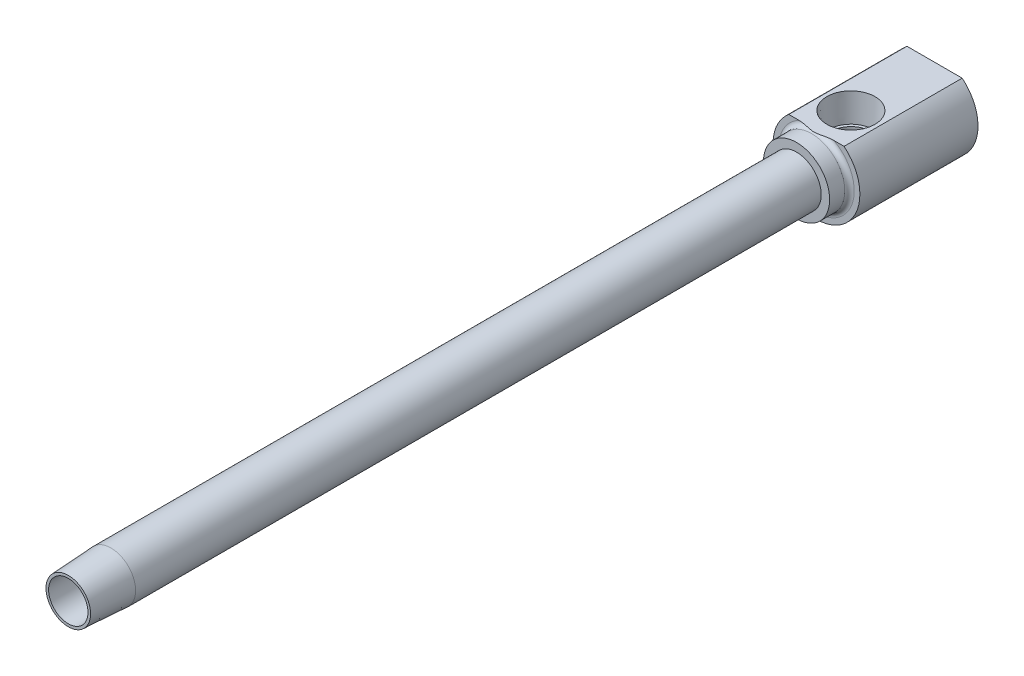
ISO-10303-21;
HEADER;
FILE_DESCRIPTION(('STEP AP214'),'2;1');
FILE_NAME('part.step','',(''),(''),'','','');
FILE_SCHEMA(('AUTOMOTIVE_DESIGN { 1 0 10303 214 1 1 1 1 }'));
ENDSEC;
DATA;
#1=APPLICATION_CONTEXT('core data for automotive mechanical design processes');
#2=APPLICATION_PROTOCOL_DEFINITION('international standard','automotive_design',2000,#1);
#3=PRODUCT_CONTEXT('',#1,'mechanical');
#4=PRODUCT('Part','Part','',(#3));
#5=PRODUCT_RELATED_PRODUCT_CATEGORY('part','',(#4));
#6=PRODUCT_DEFINITION_FORMATION('','',#4);
#7=PRODUCT_DEFINITION_CONTEXT('part definition',#1,'design');
#8=PRODUCT_DEFINITION('design','',#6,#7);
#9=PRODUCT_DEFINITION_SHAPE('','',#8);
#10=(LENGTH_UNIT() NAMED_UNIT(*) SI_UNIT(.MILLI.,.METRE.));
#11=(NAMED_UNIT(*) PLANE_ANGLE_UNIT() SI_UNIT($,.RADIAN.));
#12=(NAMED_UNIT(*) SI_UNIT($,.STERADIAN.) SOLID_ANGLE_UNIT());
#13=UNCERTAINTY_MEASURE_WITH_UNIT(LENGTH_MEASURE(1.E-05),#10,'distance_accuracy_value','');
#14=(GEOMETRIC_REPRESENTATION_CONTEXT(3) GLOBAL_UNCERTAINTY_ASSIGNED_CONTEXT((#13)) GLOBAL_UNIT_ASSIGNED_CONTEXT((#10,
#11,#12)) REPRESENTATION_CONTEXT('',''));
#15=CARTESIAN_POINT('',(0.,0.,0.));
#16=DIRECTION('',(0.,0.,1.));
#17=DIRECTION('',(1.,0.,0.));
#18=AXIS2_PLACEMENT_3D('',#15,#16,#17);
#19=CARTESIAN_POINT('',(0.,0.,-185.534766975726));
#20=DIRECTION('',(0.,0.,-1.));
#21=DIRECTION('',(-1.,0.,0.));
#22=AXIS2_PLACEMENT_3D('',#19,#20,#21);
#23=CYLINDRICAL_SURFACE('',#22,3.9751);
#24=CARTESIAN_POINT('',(0.,0.,-6.8834));
#25=DIRECTION('',(0.,0.,-1.));
#26=DIRECTION('',(-1.,0.,0.));
#27=AXIS2_PLACEMENT_3D('',#24,#25,#26);
#28=CIRCLE('',#27,3.9751);
#29=CARTESIAN_POINT('',(-3.9751,0.,-6.8834));
#30=VERTEX_POINT('',#29);
#31=EDGE_CURVE('E230',#30,#30,#28,.T.);
#32=ORIENTED_EDGE('',*,*,#31,.T.);
#33=EDGE_LOOP('',(#32));
#34=FACE_BOUND('',#33,.T.);
#35=CARTESIAN_POINT('',(0.,0.,-117.4496));
#36=DIRECTION('',(0.,0.,-1.));
#37=DIRECTION('',(-1.,0.,0.));
#38=AXIS2_PLACEMENT_3D('',#35,#36,#37);
#39=CIRCLE('',#38,3.9751);
#40=CARTESIAN_POINT('',(-3.9751,0.,-117.4496));
#41=VERTEX_POINT('',#40);
#42=EDGE_CURVE('E190',#41,#41,#39,.T.);
#43=ORIENTED_EDGE('',*,*,#42,.F.);
#44=EDGE_LOOP('',(#43));
#45=FACE_BOUND('',#44,.T.);
#46=ADVANCED_FACE('F15',(#34,#45),#23,.T.);
#47=CARTESIAN_POINT('',(-3.175,0.,-117.4496));
#48=DIRECTION('',(0.,0.,1.));
#49=DIRECTION('',(1.,0.,0.));
#50=AXIS2_PLACEMENT_3D('',#47,#48,#49);
#51=PLANE('',#50);
#52=CARTESIAN_POINT('',(0.,0.,-117.4496));
#53=DIRECTION('',(0.,0.,-1.));
#54=DIRECTION('',(-1.,0.,0.));
#55=AXIS2_PLACEMENT_3D('',#52,#53,#54);
#56=CIRCLE('',#55,3.175);
#57=CARTESIAN_POINT('',(-3.175,0.,-117.4496));
#58=VERTEX_POINT('',#57);
#59=EDGE_CURVE('E234',#58,#58,#56,.T.);
#60=ORIENTED_EDGE('',*,*,#59,.F.);
#61=EDGE_LOOP('',(#60));
#62=FACE_BOUND('',#61,.T.);
#63=CARTESIAN_POINT('',(0.,-0.206790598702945,-117.4496));
#64=DIRECTION('',(0.,0.,1.));
#65=DIRECTION('',(0.,1.,0.));
#66=AXIS2_PLACEMENT_3D('',#63,#64,#65);
#67=ELLIPSE('',#66,2.91070678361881,2.77750646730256);
#68=CARTESIAN_POINT('',(0.,2.70391618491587,-117.4496));
#69=VERTEX_POINT('',#68);
#70=EDGE_CURVE('E192',#69,#69,#67,.F.);
#71=ORIENTED_EDGE('',*,*,#70,.T.);
#72=EDGE_LOOP('',(#71));
#73=FACE_BOUND('',#72,.T.);
#74=ADVANCED_FACE('F211',(#62,#73),#51,.T.);
#75=CARTESIAN_POINT('',(-3.9751,0.,-117.4496));
#76=DIRECTION('',(0.,0.,1.));
#77=DIRECTION('',(1.,0.,0.));
#78=AXIS2_PLACEMENT_3D('',#75,#76,#77);
#79=PLANE('',#78);
#80=ORIENTED_EDGE('',*,*,#42,.T.);
#81=EDGE_LOOP('',(#80));
#82=FACE_BOUND('',#81,.T.);
#83=CARTESIAN_POINT('',(0.,0.,-117.4496));
#84=DIRECTION('',(0.,0.,-1.));
#85=DIRECTION('',(-1.,0.,0.));
#86=AXIS2_PLACEMENT_3D('',#83,#84,#85);
#87=CIRCLE('',#86,5.334);
#88=CARTESIAN_POINT('',(-5.334,0.,-117.4496));
#89=VERTEX_POINT('',#88);
#90=EDGE_CURVE('E252',#89,#89,#87,.T.);
#91=ORIENTED_EDGE('',*,*,#90,.F.);
#92=EDGE_LOOP('',(#91));
#93=FACE_BOUND('',#92,.T.);
#94=ADVANCED_FACE('F214',(#82,#93),#79,.T.);
#95=CARTESIAN_POINT('',(-3.175,0.,0.));
#96=DIRECTION('',(0.,0.,1.));
#97=DIRECTION('',(1.,0.,0.));
#98=AXIS2_PLACEMENT_3D('',#95,#96,#97);
#99=PLANE('',#98);
#100=CARTESIAN_POINT('',(0.,0.,0.));
#101=DIRECTION('',(0.,0.,-1.));
#102=DIRECTION('',(-1.,0.,0.));
#103=AXIS2_PLACEMENT_3D('',#100,#101,#102);
#104=CIRCLE('',#103,3.5941);
#105=CARTESIAN_POINT('',(-3.5941,0.,0.));
#106=VERTEX_POINT('',#105);
#107=EDGE_CURVE('E508',#106,#106,#104,.T.);
#108=ORIENTED_EDGE('',*,*,#107,.F.);
#109=EDGE_LOOP('',(#108));
#110=FACE_BOUND('',#109,.T.);
#111=CARTESIAN_POINT('',(0.,0.,0.));
#112=DIRECTION('',(0.,0.,-1.));
#113=DIRECTION('',(-1.,0.,0.));
#114=AXIS2_PLACEMENT_3D('',#111,#112,#113);
#115=CIRCLE('',#114,3.175);
#116=CARTESIAN_POINT('',(-3.175,0.,0.));
#117=VERTEX_POINT('',#116);
#118=EDGE_CURVE('E19',#117,#117,#115,.T.);
#119=ORIENTED_EDGE('',*,*,#118,.T.);
#120=EDGE_LOOP('',(#119));
#121=FACE_BOUND('',#120,.T.);
#122=ADVANCED_FACE('F17',(#110,#121),#99,.T.);
#123=CARTESIAN_POINT('',(0.,0.,-185.534766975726));
#124=DIRECTION('',(0.,0.,-1.));
#125=DIRECTION('',(-1.,0.,0.));
#126=AXIS2_PLACEMENT_3D('',#123,#124,#125);
#127=CYLINDRICAL_SURFACE('',#126,3.175);
#128=ORIENTED_EDGE('',*,*,#59,.T.);
#129=EDGE_LOOP('',(#128));
#130=FACE_BOUND('',#129,.T.);
#131=ORIENTED_EDGE('',*,*,#118,.F.);
#132=EDGE_LOOP('',(#131));
#133=FACE_BOUND('',#132,.T.);
#134=ADVANCED_FACE('F209',(#130,#133),#127,.F.);
#135=CARTESIAN_POINT('',(-7.0104,0.,-139.7));
#136=DIRECTION('',(0.,0.,-1.));
#137=DIRECTION('',(-1.,0.,0.));
#138=AXIS2_PLACEMENT_3D('',#135,#136,#137);
#139=PLANE('',#138);
#140=DIRECTION('',(1.,0.,0.));
#141=VECTOR('',#140,1.);
#142=CARTESIAN_POINT('',(-1.83308710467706,3.175,-139.7));
#143=LINE('',#142,#141);
#144=CARTESIAN_POINT('',(-1.83308710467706,3.175,-139.7));
#145=VERTEX_POINT('',#144);
#146=CARTESIAN_POINT('',(1.83308710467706,3.175,-139.7));
#147=VERTEX_POINT('',#146);
#148=EDGE_CURVE('E37',#145,#147,#143,.T.);
#149=ORIENTED_EDGE('',*,*,#148,.F.);
#150=DIRECTION('',(0.5,0.866025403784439,0.));
#151=VECTOR('',#150,1.);
#152=CARTESIAN_POINT('',(-3.66617420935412,0.,-139.7));
#153=LINE('',#152,#151);
#154=CARTESIAN_POINT('',(-3.66617420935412,0.,-139.7));
#155=VERTEX_POINT('',#154);
#156=EDGE_CURVE('E278',#155,#145,#153,.T.);
#157=ORIENTED_EDGE('',*,*,#156,.F.);
#158=DIRECTION('',(-0.5,0.866025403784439,0.));
#159=VECTOR('',#158,1.);
#160=CARTESIAN_POINT('',(-1.83308710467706,-3.175,-139.7));
#161=LINE('',#160,#159);
#162=CARTESIAN_POINT('',(-1.83308710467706,-3.175,-139.7));
#163=VERTEX_POINT('',#162);
#164=EDGE_CURVE('E282',#163,#155,#161,.T.);
#165=ORIENTED_EDGE('',*,*,#164,.F.);
#166=DIRECTION('',(-1.,0.,0.));
#167=VECTOR('',#166,1.);
#168=CARTESIAN_POINT('',(1.83308710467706,-3.175,-139.7));
#169=LINE('',#168,#167);
#170=CARTESIAN_POINT('',(1.83308710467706,-3.175,-139.7));
#171=VERTEX_POINT('',#170);
#172=EDGE_CURVE('E285',#171,#163,#169,.T.);
#173=ORIENTED_EDGE('',*,*,#172,.F.);
#174=DIRECTION('',(-0.5,-0.866025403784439,0.));
#175=VECTOR('',#174,1.);
#176=CARTESIAN_POINT('',(3.66617420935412,0.,-139.7));
#177=LINE('',#176,#175);
#178=CARTESIAN_POINT('',(3.66617420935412,0.,-139.7));
#179=VERTEX_POINT('',#178);
#180=EDGE_CURVE('E288',#179,#171,#177,.T.);
#181=ORIENTED_EDGE('',*,*,#180,.F.);
#182=DIRECTION('',(0.5,-0.866025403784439,0.));
#183=VECTOR('',#182,1.);
#184=CARTESIAN_POINT('',(1.83308710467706,3.175,-139.7));
#185=LINE('',#184,#183);
#186=EDGE_CURVE('E291',#147,#179,#185,.T.);
#187=ORIENTED_EDGE('',*,*,#186,.F.);
#188=EDGE_LOOP('',(#149,#157,#165,#173,#181,#187));
#189=FACE_BOUND('',#188,.T.);
#190=DIRECTION('',(-1.,0.,0.));
#191=VECTOR('',#190,1.);
#192=CARTESIAN_POINT('',(-4.4577,5.41060244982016,-139.7));
#193=LINE('',#192,#191);
#194=CARTESIAN_POINT('',(4.4577,5.41060244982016,-139.7));
#195=VERTEX_POINT('',#194);
#196=CARTESIAN_POINT('',(-4.4577,5.41060244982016,-139.7));
#197=VERTEX_POINT('',#196);
#198=EDGE_CURVE('E261',#195,#197,#193,.T.);
#199=ORIENTED_EDGE('',*,*,#198,.F.);
#200=CARTESIAN_POINT('',(0.,0.,-139.7));
#201=DIRECTION('',(0.,0.,-1.));
#202=DIRECTION('',(-1.,0.,0.));
#203=AXIS2_PLACEMENT_3D('',#200,#201,#202);
#204=CIRCLE('',#203,7.0104);
#205=EDGE_CURVE('E238',#195,#197,#204,.T.);
#206=ORIENTED_EDGE('',*,*,#205,.T.);
#207=EDGE_LOOP('',(#199,#206));
#208=FACE_BOUND('',#207,.T.);
#209=ADVANCED_FACE('F205',(#189,#208),#139,.T.);
#210=CARTESIAN_POINT('',(0.,0.,-185.534766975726));
#211=DIRECTION('',(0.,0.,-1.));
#212=DIRECTION('',(-1.,0.,0.));
#213=AXIS2_PLACEMENT_3D('',#210,#211,#212);
#214=CYLINDRICAL_SURFACE('',#213,7.0104);
#215=DIRECTION('',(0.,0.,-1.));
#216=VECTOR('',#215,1.);
#217=CARTESIAN_POINT('',(-4.4577,5.41060244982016,-110.3376));
#218=LINE('',#217,#216);
#219=CARTESIAN_POINT('',(-4.4577,5.41060244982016,-120.65));
#220=VERTEX_POINT('',#219);
#221=EDGE_CURVE('E258',#220,#197,#218,.T.);
#222=ORIENTED_EDGE('',*,*,#221,.T.);
#223=ORIENTED_EDGE('',*,*,#205,.F.);
#224=DIRECTION('',(0.,0.,-1.));
#225=VECTOR('',#224,1.);
#226=CARTESIAN_POINT('',(4.4577,5.41060244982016,-110.3376));
#227=LINE('',#226,#225);
#228=CARTESIAN_POINT('',(4.4577,5.41060244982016,-120.65));
#229=VERTEX_POINT('',#228);
#230=EDGE_CURVE('E259',#229,#195,#227,.T.);
#231=ORIENTED_EDGE('',*,*,#230,.F.);
#232=CARTESIAN_POINT('',(0.,0.,-120.65));
#233=DIRECTION('',(0.,0.,-1.));
#234=DIRECTION('',(-1.,0.,0.));
#235=AXIS2_PLACEMENT_3D('',#232,#233,#234);
#236=CIRCLE('',#235,7.0104);
#237=EDGE_CURVE('E241',#229,#220,#236,.T.);
#238=ORIENTED_EDGE('',*,*,#237,.T.);
#239=EDGE_LOOP('',(#222,#223,#231,#238));
#240=FACE_BOUND('',#239,.T.);
#241=ADVANCED_FACE('F201',(#240),#214,.T.);
#242=CARTESIAN_POINT('',(-6.096,0.,-120.65));
#243=DIRECTION('',(0.,0.,1.));
#244=DIRECTION('',(1.,0.,0.));
#245=AXIS2_PLACEMENT_3D('',#242,#243,#244);
#246=PLANE('',#245);
#247=DIRECTION('',(1.,0.,0.));
#248=VECTOR('',#247,1.);
#249=CARTESIAN_POINT('',(-6.096,5.41060244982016,-120.65));
#250=LINE('',#249,#248);
#251=CARTESIAN_POINT('',(-2.80830858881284,5.41060244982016,-120.65));
#252=VERTEX_POINT('',#251);
#253=EDGE_CURVE('E255',#220,#252,#250,.T.);
#254=ORIENTED_EDGE('',*,*,#253,.F.);
#255=ORIENTED_EDGE('',*,*,#237,.F.);
#256=CARTESIAN_POINT('',(2.80830858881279,5.41060244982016,-120.65));
#257=VERTEX_POINT('',#256);
#258=EDGE_CURVE('E256',#257,#229,#250,.T.);
#259=ORIENTED_EDGE('',*,*,#258,.F.);
#260=CARTESIAN_POINT('',(0.,0.,-120.65));
#261=DIRECTION('',(0.,0.,-1.));
#262=DIRECTION('',(-1.,0.,0.));
#263=AXIS2_PLACEMENT_3D('',#260,#261,#262);
#264=CIRCLE('',#263,6.096);
#265=EDGE_CURVE('E246',#257,#252,#264,.T.);
#266=ORIENTED_EDGE('',*,*,#265,.T.);
#267=EDGE_LOOP('',(#254,#255,#259,#266));
#268=FACE_BOUND('',#267,.T.);
#269=ADVANCED_FACE('F197',(#268),#246,.T.);
#270=CARTESIAN_POINT('',(0.,0.,-119.888));
#271=DIRECTION('',(0.,0.,-1.));
#272=DIRECTION('',(-1.,0.,0.));
#273=AXIS2_PLACEMENT_3D('',#270,#271,#272);
#274=TOROIDAL_SURFACE('',#273,6.096,0.762);
#275=CARTESIAN_POINT('',(0.,5.41060244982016,-120.220977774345));
#276=CARTESIAN_POINT('',(0.0521470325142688,5.41060244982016,-120.220966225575));
#277=CARTESIAN_POINT('',(0.104287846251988,5.41060244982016,-120.222542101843));
#278=CARTESIAN_POINT('',(0.208401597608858,5.41060244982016,-120.228631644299));
#279=CARTESIAN_POINT('',(0.260374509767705,5.41060244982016,-120.233145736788));
#280=CARTESIAN_POINT('',(0.416241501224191,5.41060244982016,-120.250448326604));
#281=CARTESIAN_POINT('',(0.519704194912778,5.41060244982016,-120.266991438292));
#282=CARTESIAN_POINT('',(0.726918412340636,5.41060244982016,-120.305619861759));
#283=CARTESIAN_POINT('',(0.830655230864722,5.41060244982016,-120.327776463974));
#284=CARTESIAN_POINT('',(1.03759009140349,5.41060244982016,-120.373840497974));
#285=CARTESIAN_POINT('',(1.14078865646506,5.41060244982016,-120.397745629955));
#286=CARTESIAN_POINT('',(1.34834228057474,5.41060244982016,-120.445205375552));
#287=CARTESIAN_POINT('',(1.4526986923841,5.41060244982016,-120.468754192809));
#288=CARTESIAN_POINT('',(1.6619797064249,5.41060244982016,-120.513460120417));
#289=CARTESIAN_POINT('',(1.76690452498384,5.41060244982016,-120.534616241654));
#290=CARTESIAN_POINT('',(1.97693672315,5.41060244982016,-120.572852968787));
#291=CARTESIAN_POINT('',(2.08204009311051,5.41060244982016,-120.589954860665));
#292=CARTESIAN_POINT('',(2.29298648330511,5.41060244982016,-120.618645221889));
#293=CARTESIAN_POINT('',(2.39882937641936,5.41060244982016,-120.630234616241));
#294=CARTESIAN_POINT('',(2.63825679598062,5.41060244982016,-120.648170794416));
#295=CARTESIAN_POINT('',(2.77203238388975,5.41060244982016,-120.652426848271));
#296=CARTESIAN_POINT('',(2.97236053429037,5.41060244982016,-120.64675427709));
#297=CARTESIAN_POINT('',(3.03908464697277,5.41060244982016,-120.64285339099));
#298=CARTESIAN_POINT('',(3.17206397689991,5.41060244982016,-120.630250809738));
#299=CARTESIAN_POINT('',(3.23831943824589,5.41060244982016,-120.621551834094));
#300=CARTESIAN_POINT('',(3.37725624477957,5.41060244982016,-120.59711512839));
#301=CARTESIAN_POINT('',(3.44982215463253,5.41060244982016,-120.58069575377));
#302=CARTESIAN_POINT('',(3.59245961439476,5.41060244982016,-120.539071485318));
#303=CARTESIAN_POINT('',(3.66253326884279,5.41060244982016,-120.513874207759));
#304=CARTESIAN_POINT('',(3.77900159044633,5.41060244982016,-120.461023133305));
#305=CARTESIAN_POINT('',(3.82657256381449,5.41060244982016,-120.435989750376));
#306=CARTESIAN_POINT('',(3.91754959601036,5.41060244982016,-120.379184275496));
#307=CARTESIAN_POINT('',(3.96096325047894,5.41060244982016,-120.347424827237));
#308=CARTESIAN_POINT('',(4.02798010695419,5.41060244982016,-120.28789070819));
#309=CARTESIAN_POINT('',(4.05342428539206,5.41060244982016,-120.262198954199));
#310=CARTESIAN_POINT('',(4.10009948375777,5.41060244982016,-120.207215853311));
#311=CARTESIAN_POINT('',(4.12133630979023,5.41060244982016,-120.177929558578));
#312=CARTESIAN_POINT('',(4.15466127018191,5.41060244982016,-120.12188761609));
#313=CARTESIAN_POINT('',(4.16772173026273,5.41060244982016,-120.095714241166));
#314=CARTESIAN_POINT('',(4.18933719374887,5.41060244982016,-120.041556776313));
#315=CARTESIAN_POINT('',(4.19789541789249,5.41060244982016,-120.013573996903));
#316=CARTESIAN_POINT('',(4.20987180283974,5.41060244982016,-119.956334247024));
#317=CARTESIAN_POINT('',(4.21325884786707,5.41060244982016,-119.927070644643));
#318=CARTESIAN_POINT('',(4.21447858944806,5.41060244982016,-119.868428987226));
#319=CARTESIAN_POINT('',(4.21231242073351,5.41060244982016,-119.839050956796));
#320=CARTESIAN_POINT('',(4.20309810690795,5.41060244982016,-119.783964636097));
#321=CARTESIAN_POINT('',(4.19653350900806,5.41060244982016,-119.758172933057));
#322=CARTESIAN_POINT('',(4.17948851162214,5.41060244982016,-119.707930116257));
#323=CARTESIAN_POINT('',(4.16900680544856,5.41060244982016,-119.683479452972));
#324=CARTESIAN_POINT('',(4.14035818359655,5.41060244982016,-119.627852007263));
#325=CARTESIAN_POINT('',(4.12078333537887,5.41060244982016,-119.59740126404));
#326=CARTESIAN_POINT('',(4.07697861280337,5.41060244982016,-119.540060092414));
#327=CARTESIAN_POINT('',(4.05273917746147,5.41060244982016,-119.513177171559));
#328=CARTESIAN_POINT('',(3.98868725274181,5.41060244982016,-119.451156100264));
#329=CARTESIAN_POINT('',(3.94690497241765,5.41060244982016,-119.418064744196));
#330=CARTESIAN_POINT('',(3.85879527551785,5.41060244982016,-119.358693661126));
#331=CARTESIAN_POINT('',(3.81245915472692,5.41060244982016,-119.332427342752));
#332=CARTESIAN_POINT('',(3.7245267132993,5.41060244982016,-119.289445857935));
#333=CARTESIAN_POINT('',(3.6833382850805,5.41060244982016,-119.271877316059));
#334=CARTESIAN_POINT('',(3.59958587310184,5.41060244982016,-119.240360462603));
#335=CARTESIAN_POINT('',(3.55702092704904,5.41060244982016,-119.226414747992));
#336=CARTESIAN_POINT('',(3.42786902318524,5.41060244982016,-119.189290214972));
#337=CARTESIAN_POINT('',(3.33991210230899,5.41060244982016,-119.170863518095));
#338=CARTESIAN_POINT('',(3.16528158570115,5.41060244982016,-119.144240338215));
#339=CARTESIAN_POINT('',(3.07864723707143,5.41060244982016,-119.135756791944));
#340=CARTESIAN_POINT('',(2.90489485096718,5.41060244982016,-119.126131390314));
#341=CARTESIAN_POINT('',(2.8177763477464,5.41060244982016,-119.124998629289));
#342=CARTESIAN_POINT('',(2.64327811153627,5.41060244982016,-119.12865046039));
#343=CARTESIAN_POINT('',(2.55589913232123,5.41060244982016,-119.133463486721));
#344=CARTESIAN_POINT('',(2.38166962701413,5.41060244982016,-119.147864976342));
#345=CARTESIAN_POINT('',(2.29481855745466,5.41060244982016,-119.157447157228));
#346=CARTESIAN_POINT('',(2.01384766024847,5.41060244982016,-119.194670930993));
#347=CARTESIAN_POINT('',(1.82076533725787,5.41060244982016,-119.229945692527));
#348=CARTESIAN_POINT('',(1.53229430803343,5.41060244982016,-119.289884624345));
#349=CARTESIAN_POINT('',(1.43609183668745,5.41060244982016,-119.311096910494));
#350=CARTESIAN_POINT('',(1.24390982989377,5.41060244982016,-119.354534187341));
#351=CARTESIAN_POINT('',(1.14793028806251,5.41060244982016,-119.376759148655));
#352=CARTESIAN_POINT('',(0.957697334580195,5.41060244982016,-119.420093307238));
#353=CARTESIAN_POINT('',(0.863446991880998,5.41060244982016,-119.441215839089));
#354=CARTESIAN_POINT('',(0.674290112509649,5.41060244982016,-119.480544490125));
#355=CARTESIAN_POINT('',(0.579383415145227,5.41060244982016,-119.498749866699));
#356=CARTESIAN_POINT('',(0.389272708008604,5.41060244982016,-119.528753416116));
#357=CARTESIAN_POINT('',(0.294077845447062,5.41060244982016,-119.540603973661));
#358=CARTESIAN_POINT('',(0.150791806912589,5.41060244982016,-119.551139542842));
#359=CARTESIAN_POINT('',(0.102969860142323,5.41060244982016,-119.553445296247));
#360=CARTESIAN_POINT('',(0.0072742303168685,5.41060244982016,-119.5554444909));
#361=CARTESIAN_POINT('',(-0.0405994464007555,5.41060244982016,-119.555138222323));
#362=CARTESIAN_POINT('',(-0.136934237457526,5.41060244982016,-119.551917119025));
#363=CARTESIAN_POINT('',(-0.185394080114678,5.41060244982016,-119.548965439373));
#364=CARTESIAN_POINT('',(-0.282118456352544,5.41060244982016,-119.540689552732));
#365=CARTESIAN_POINT('',(-0.330382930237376,5.41060244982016,-119.535364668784));
#366=CARTESIAN_POINT('',(-0.475151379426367,5.41060244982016,-119.516449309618));
#367=CARTESIAN_POINT('',(-0.571263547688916,5.41060244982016,-119.499936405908));
#368=CARTESIAN_POINT('',(-0.764047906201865,5.41060244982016,-119.462565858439));
#369=CARTESIAN_POINT('',(-0.860707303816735,5.41060244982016,-119.441647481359));
#370=CARTESIAN_POINT('',(-1.05357295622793,5.41060244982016,-119.398459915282));
#371=CARTESIAN_POINT('',(-1.1497796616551,5.41060244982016,-119.376192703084));
#372=CARTESIAN_POINT('',(-1.36433899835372,5.41060244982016,-119.327144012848));
#373=CARTESIAN_POINT('',(-1.48272280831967,5.41060244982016,-119.300495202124));
#374=CARTESIAN_POINT('',(-1.72029970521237,5.41060244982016,-119.250573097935));
#375=CARTESIAN_POINT('',(-1.83949323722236,5.41060244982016,-119.227301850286));
#376=CARTESIAN_POINT('',(-2.0778976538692,5.41060244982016,-119.186591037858));
#377=CARTESIAN_POINT('',(-2.19710038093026,5.41060244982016,-119.169105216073));
#378=CARTESIAN_POINT('',(-2.43636519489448,5.41060244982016,-119.142063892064));
#379=CARTESIAN_POINT('',(-2.55642644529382,5.41060244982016,-119.132501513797));
#380=CARTESIAN_POINT('',(-2.76780194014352,5.41060244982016,-119.125164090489));
#381=CARTESIAN_POINT('',(-2.85902659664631,5.41060244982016,-119.125092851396));
#382=CARTESIAN_POINT('',(-3.04144991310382,5.41060244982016,-119.132751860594));
#383=CARTESIAN_POINT('',(-3.13264774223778,5.41060244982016,-119.140504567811));
#384=CARTESIAN_POINT('',(-3.31458996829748,5.41060244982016,-119.166086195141));
#385=CARTESIAN_POINT('',(-3.40532344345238,5.41060244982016,-119.184002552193));
#386=CARTESIAN_POINT('',(-3.53857286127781,5.41060244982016,-119.220698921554));
#387=CARTESIAN_POINT('',(-3.58245316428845,5.41060244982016,-119.234541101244));
#388=CARTESIAN_POINT('',(-3.66883050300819,5.41060244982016,-119.265985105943));
#389=CARTESIAN_POINT('',(-3.71132868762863,5.41060244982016,-119.283583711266));
#390=CARTESIAN_POINT('',(-3.79234387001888,5.41060244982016,-119.322178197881));
#391=CARTESIAN_POINT('',(-3.83095410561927,5.41060244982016,-119.342975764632));
#392=CARTESIAN_POINT('',(-3.90549335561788,5.41060244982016,-119.389081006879));
#393=CARTESIAN_POINT('',(-3.94141935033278,5.41060244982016,-119.414393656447));
#394=CARTESIAN_POINT('',(-4.00964525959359,5.41060244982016,-119.470392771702));
#395=CARTESIAN_POINT('',(-4.04189445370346,5.41060244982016,-119.501142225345));
#396=CARTESIAN_POINT('',(-4.10014383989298,5.41060244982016,-119.568084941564));
#397=CARTESIAN_POINT('',(-4.12616464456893,5.41060244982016,-119.604259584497));
#398=CARTESIAN_POINT('',(-4.16162371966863,5.41060244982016,-119.667760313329));
#399=CARTESIAN_POINT('',(-4.17366550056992,5.41060244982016,-119.693633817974));
#400=CARTESIAN_POINT('',(-4.19334521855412,5.41060244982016,-119.747014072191));
#401=CARTESIAN_POINT('',(-4.20098675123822,5.41060244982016,-119.774519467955));
#402=CARTESIAN_POINT('',(-4.21130602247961,5.41060244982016,-119.83060948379));
#403=CARTESIAN_POINT('',(-4.21395773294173,5.41060244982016,-119.859198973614));
#404=CARTESIAN_POINT('',(-4.21398264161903,5.41060244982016,-119.916380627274));
#405=CARTESIAN_POINT('',(-4.21135613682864,5.41060244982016,-119.944972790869));
#406=CARTESIAN_POINT('',(-4.20143815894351,5.41060244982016,-119.999159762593));
#407=CARTESIAN_POINT('',(-4.1945008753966,5.41060244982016,-120.024821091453));
#408=CARTESIAN_POINT('',(-4.17676949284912,5.41060244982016,-120.074761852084));
#409=CARTESIAN_POINT('',(-4.1659739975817,5.41060244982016,-120.099040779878));
#410=CARTESIAN_POINT('',(-4.13643456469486,5.41060244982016,-120.154664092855));
#411=CARTESIAN_POINT('',(-4.11622825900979,5.41060244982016,-120.18523117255));
#412=CARTESIAN_POINT('',(-4.0711573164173,5.41060244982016,-120.242709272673));
#413=CARTESIAN_POINT('',(-4.04628281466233,5.41060244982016,-120.269612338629));
#414=CARTESIAN_POINT('',(-3.98047143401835,5.41060244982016,-120.331796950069));
#415=CARTESIAN_POINT('',(-3.937534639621,5.41060244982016,-120.364948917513));
#416=CARTESIAN_POINT('',(-3.84713170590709,5.41060244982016,-120.424276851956));
#417=CARTESIAN_POINT('',(-3.79965701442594,5.41060244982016,-120.450439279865));
#418=CARTESIAN_POINT('',(-3.70945527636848,5.41060244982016,-120.493219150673));
#419=CARTESIAN_POINT('',(-3.66712202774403,5.41060244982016,-120.510685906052));
#420=CARTESIAN_POINT('',(-3.58109351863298,5.41060244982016,-120.541903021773));
#421=CARTESIAN_POINT('',(-3.53739729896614,5.41060244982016,-120.555650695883));
#422=CARTESIAN_POINT('',(-3.40486938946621,5.41060244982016,-120.592069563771));
#423=CARTESIAN_POINT('',(-3.3146965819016,5.41060244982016,-120.609873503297));
#424=CARTESIAN_POINT('',(-3.13512177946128,5.41060244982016,-120.635172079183));
#425=CARTESIAN_POINT('',(-3.04574747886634,5.41060244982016,-120.642887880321));
#426=CARTESIAN_POINT('',(-2.86659161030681,5.41060244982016,-120.650757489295));
#427=CARTESIAN_POINT('',(-2.77680968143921,5.41060244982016,-120.650902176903));
#428=CARTESIAN_POINT('',(-2.59707026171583,5.41060244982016,-120.645129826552));
#429=CARTESIAN_POINT('',(-2.5071138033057,5.41060244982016,-120.639185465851));
#430=CARTESIAN_POINT('',(-2.32777785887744,5.41060244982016,-120.622449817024));
#431=CARTESIAN_POINT('',(-2.23839782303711,5.41060244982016,-120.611664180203));
#432=CARTESIAN_POINT('',(-1.96748151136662,5.41060244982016,-120.57309869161));
#433=CARTESIAN_POINT('',(-1.78682109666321,5.41060244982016,-120.539313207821));
#434=CARTESIAN_POINT('',(-1.51682052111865,5.41060244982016,-120.48271359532));
#435=CARTESIAN_POINT('',(-1.42679945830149,5.41060244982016,-120.46281263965));
#436=CARTESIAN_POINT('',(-1.24695389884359,5.41060244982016,-120.422143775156));
#437=CARTESIAN_POINT('',(-1.15712938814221,5.41060244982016,-120.401375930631));
#438=CARTESIAN_POINT('',(-0.979057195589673,5.41060244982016,-120.360739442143));
#439=CARTESIAN_POINT('',(-0.89081169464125,5.41060244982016,-120.340861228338));
#440=CARTESIAN_POINT('',(-0.713780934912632,5.41060244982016,-120.303401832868));
#441=CARTESIAN_POINT('',(-0.624995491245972,5.41060244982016,-120.285821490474));
#442=CARTESIAN_POINT('',(-0.447203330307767,5.41060244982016,-120.255660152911));
#443=CARTESIAN_POINT('',(-0.358203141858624,5.41060244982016,-120.243043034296));
#444=CARTESIAN_POINT('',(-0.179461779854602,5.41060244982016,-120.225716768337));
#445=CARTESIAN_POINT('',(-0.0897216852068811,5.41060244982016,-120.220997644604));
#446=CARTESIAN_POINT('',(0.,5.41060244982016,-120.220977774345));
#447=B_SPLINE_CURVE_WITH_KNOTS('',3,(#275,#276,#277,#278,#279,#280,#281,#282,#283,#284,#285,
#286,#287,#288,#289,#290,#291,#292,#293,#294,#295,#296,#297,#298,#299,#300,#301,#302,#303,#304,
#305,#306,#307,#308,#309,#310,#311,#312,#313,#314,#315,#316,#317,#318,#319,#320,#321,#322,#323,
#324,#325,#326,#327,#328,#329,#330,#331,#332,#333,#334,#335,#336,#337,#338,#339,#340,#341,#342,
#343,#344,#345,#346,#347,#348,#349,#350,#351,#352,#353,#354,#355,#356,#357,#358,#359,#360,#361,
#362,#363,#364,#365,#366,#367,#368,#369,#370,#371,#372,#373,#374,#375,#376,#377,#378,#379,#380,
#381,#382,#383,#384,#385,#386,#387,#388,#389,#390,#391,#392,#393,#394,#395,#396,#397,#398,#399,
#400,#401,#402,#403,#404,#405,#406,#407,#408,#409,#410,#411,#412,#413,#414,#415,#416,#417,#418,
#419,#420,#421,#422,#423,#424,#425,#426,#427,#428,#429,#430,#431,#432,#433,#434,#435,#436,#437,
#438,#439,#440,#441,#442,#443,#444,#445,#446),.UNSPECIFIED.,.T.,.F.,(4,2,2,2,2,2,2,2,2,2,2,2,2,
2,2,2,2,2,2,2,2,2,2,2,2,2,2,2,2,2,2,2,2,2,2,2,2,2,2,2,2,2,2,2,2,2,2,2,2,2,2,2,2,2,2,2,2,2,2,2,2,
2,2,2,2,2,2,2,2,2,2,2,2,2,2,2,2,2,2,2,2,2,2,2,2,4),(0.,0.156408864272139,0.312840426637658,
0.626836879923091,0.945040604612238,1.26283307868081,1.58376524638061,1.90482960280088,
2.22416896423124,2.54345472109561,2.94416590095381,3.14454518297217,3.34481100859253,
3.56760205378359,3.79020027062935,3.95104939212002,4.11159879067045,4.21974493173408,
4.32774077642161,4.4151439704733,4.50248455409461,4.59034863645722,4.67819476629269,
4.75769203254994,4.83721584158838,4.94521135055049,5.05343062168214,5.2124385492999,
5.37175654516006,5.50590155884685,5.64014246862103,5.90890810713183,6.16970670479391,
6.43082789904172,6.69320268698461,6.95523275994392,7.54340798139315,7.83896772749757,
8.13451890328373,8.42427298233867,8.71410070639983,9.00150106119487,9.14506775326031,
9.28861849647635,9.43420020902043,9.57982347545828,9.87216797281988,10.1688428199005,
10.4650929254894,10.8291174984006,11.193361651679,11.5546188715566,11.9155622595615,
12.1889721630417,12.4631691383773,12.7397615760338,12.8776619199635,13.0154445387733,
13.1467577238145,13.2782164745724,13.4113120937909,13.5439609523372,13.6292456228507,
13.7144605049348,13.8001186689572,13.8857720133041,13.9651785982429,14.0446139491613,
14.1539273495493,14.2634744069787,14.4253063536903,14.5874495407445,14.7246386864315,
14.8619266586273,15.1368206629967,15.4055810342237,15.6746651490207,15.9449620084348,
16.2149441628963,16.7658370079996,17.0424344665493,17.319011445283,17.5903768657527,
17.8618411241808,18.1312913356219,18.4004009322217),.UNSPECIFIED.);
#448=EDGE_CURVE('E105',#252,#257,#447,.T.);
#449=ORIENTED_EDGE('',*,*,#448,.F.);
#450=ORIENTED_EDGE('',*,*,#265,.F.);
#451=EDGE_LOOP('',(#449,#450));
#452=FACE_BOUND('',#451,.T.);
#453=CARTESIAN_POINT('',(0.,0.,-119.888));
#454=DIRECTION('',(0.,0.,-1.));
#455=DIRECTION('',(-1.,0.,0.));
#456=AXIS2_PLACEMENT_3D('',#453,#454,#455);
#457=CIRCLE('',#456,5.334);
#458=CARTESIAN_POINT('',(-5.334,0.,-119.888));
#459=VERTEX_POINT('',#458);
#460=EDGE_CURVE('E249',#459,#459,#457,.T.);
#461=ORIENTED_EDGE('',*,*,#460,.T.);
#462=EDGE_LOOP('',(#461));
#463=FACE_BOUND('',#462,.T.);
#464=ADVANCED_FACE('F193',(#452,#463),#274,.F.);
#465=CARTESIAN_POINT('',(0.,0.,-185.534766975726));
#466=DIRECTION('',(0.,0.,-1.));
#467=DIRECTION('',(-1.,0.,0.));
#468=AXIS2_PLACEMENT_3D('',#465,#466,#467);
#469=CYLINDRICAL_SURFACE('',#468,5.334);
#470=ORIENTED_EDGE('',*,*,#90,.T.);
#471=EDGE_LOOP('',(#470));
#472=FACE_BOUND('',#471,.T.);
#473=ORIENTED_EDGE('',*,*,#460,.F.);
#474=EDGE_LOOP('',(#473));
#475=FACE_BOUND('',#474,.T.);
#476=ADVANCED_FACE('F183',(#472,#475),#469,.T.);
#477=CARTESIAN_POINT('',(-4.4577,5.41060244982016,-110.3376));
#478=DIRECTION('',(0.,-1.,0.));
#479=DIRECTION('',(0.,0.,-1.));
#480=AXIS2_PLACEMENT_3D('',#477,#478,#479);
#481=PLANE('',#480);
#482=CARTESIAN_POINT('',(0.,5.41060244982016,-126.2126));
#483=DIRECTION('',(0.,-1.,0.));
#484=DIRECTION('',(0.,0.,-1.));
#485=AXIS2_PLACEMENT_3D('',#482,#483,#484);
#486=CIRCLE('',#485,3.8800785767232);
#487=CARTESIAN_POINT('',(0.,5.41060244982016,-130.092678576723));
#488=VERTEX_POINT('',#487);
#489=EDGE_CURVE('E510',#488,#488,#486,.T.);
#490=ORIENTED_EDGE('',*,*,#489,.T.);
#491=EDGE_LOOP('',(#490));
#492=FACE_BOUND('',#491,.T.);
#493=ORIENTED_EDGE('',*,*,#253,.T.);
#494=ORIENTED_EDGE('',*,*,#448,.T.);
#495=ORIENTED_EDGE('',*,*,#258,.T.);
#496=ORIENTED_EDGE('',*,*,#230,.T.);
#497=ORIENTED_EDGE('',*,*,#198,.T.);
#498=ORIENTED_EDGE('',*,*,#221,.F.);
#499=EDGE_LOOP('',(#493,#494,#495,#496,#497,#498));
#500=FACE_BOUND('',#499,.T.);
#501=ADVANCED_FACE('F179',(#492,#500),#481,.F.);
#502=CARTESIAN_POINT('',(-1.83308710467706,3.175,-134.874));
#503=DIRECTION('',(0.,1.,0.));
#504=DIRECTION('',(-1.,0.,0.));
#505=AXIS2_PLACEMENT_3D('',#502,#503,#504);
#506=PLANE('',#505);
#507=ORIENTED_EDGE('',*,*,#148,.T.);
#508=DIRECTION('',(0.,0.,-1.));
#509=VECTOR('',#508,1.);
#510=CARTESIAN_POINT('',(1.83308710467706,3.175,-134.874));
#511=LINE('',#510,#509);
#512=CARTESIAN_POINT('',(1.83308710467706,3.175,-134.874));
#513=VERTEX_POINT('',#512);
#514=EDGE_CURVE('E266',#513,#147,#511,.T.);
#515=ORIENTED_EDGE('',*,*,#514,.F.);
#516=DIRECTION('',(1.,0.,0.));
#517=VECTOR('',#516,1.);
#518=CARTESIAN_POINT('',(-1.83308710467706,3.175,-134.874));
#519=LINE('',#518,#517);
#520=CARTESIAN_POINT('',(-1.83308710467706,3.175,-134.874));
#521=VERTEX_POINT('',#520);
#522=EDGE_CURVE('E281',#521,#513,#519,.T.);
#523=ORIENTED_EDGE('',*,*,#522,.F.);
#524=DIRECTION('',(0.,0.,-1.));
#525=VECTOR('',#524,1.);
#526=CARTESIAN_POINT('',(-1.83308710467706,3.175,-134.874));
#527=LINE('',#526,#525);
#528=EDGE_CURVE('E265',#521,#145,#527,.T.);
#529=ORIENTED_EDGE('',*,*,#528,.T.);
#530=EDGE_LOOP('',(#507,#515,#523,#529));
#531=FACE_BOUND('',#530,.T.);
#532=ADVANCED_FACE('F161',(#531),#506,.F.);
#533=CARTESIAN_POINT('',(-3.66617420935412,0.,-134.874));
#534=DIRECTION('',(-0.866025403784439,0.5,0.));
#535=DIRECTION('',(-0.5,-0.866025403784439,0.));
#536=AXIS2_PLACEMENT_3D('',#533,#534,#535);
#537=PLANE('',#536);
#538=ORIENTED_EDGE('',*,*,#156,.T.);
#539=ORIENTED_EDGE('',*,*,#528,.F.);
#540=DIRECTION('',(0.5,0.866025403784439,0.));
#541=VECTOR('',#540,1.);
#542=CARTESIAN_POINT('',(-3.66617420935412,0.,-134.874));
#543=LINE('',#542,#541);
#544=CARTESIAN_POINT('',(-3.66617420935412,0.,-134.874));
#545=VERTEX_POINT('',#544);
#546=EDGE_CURVE('E269',#545,#521,#543,.T.);
#547=ORIENTED_EDGE('',*,*,#546,.F.);
#548=DIRECTION('',(0.,0.,-1.));
#549=VECTOR('',#548,1.);
#550=CARTESIAN_POINT('',(-3.66617420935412,0.,-134.874));
#551=LINE('',#550,#549);
#552=EDGE_CURVE('E275',#545,#155,#551,.T.);
#553=ORIENTED_EDGE('',*,*,#552,.T.);
#554=EDGE_LOOP('',(#538,#539,#547,#553));
#555=FACE_BOUND('',#554,.T.);
#556=ADVANCED_FACE('F157',(#555),#537,.F.);
#557=CARTESIAN_POINT('',(-1.83308710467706,-3.175,-134.874));
#558=DIRECTION('',(-0.866025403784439,-0.5,0.));
#559=DIRECTION('',(0.5,-0.866025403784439,0.));
#560=AXIS2_PLACEMENT_3D('',#557,#558,#559);
#561=PLANE('',#560);
#562=ORIENTED_EDGE('',*,*,#164,.T.);
#563=ORIENTED_EDGE('',*,*,#552,.F.);
#564=DIRECTION('',(-0.5,0.866025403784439,0.));
#565=VECTOR('',#564,1.);
#566=CARTESIAN_POINT('',(-1.83308710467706,-3.175,-134.874));
#567=LINE('',#566,#565);
#568=CARTESIAN_POINT('',(-1.83308710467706,-3.175,-134.874));
#569=VERTEX_POINT('',#568);
#570=EDGE_CURVE('E297',#569,#545,#567,.T.);
#571=ORIENTED_EDGE('',*,*,#570,.F.);
#572=DIRECTION('',(0.,0.,-1.));
#573=VECTOR('',#572,1.);
#574=CARTESIAN_POINT('',(-1.83308710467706,-3.175,-134.874));
#575=LINE('',#574,#573);
#576=EDGE_CURVE('E273',#569,#163,#575,.T.);
#577=ORIENTED_EDGE('',*,*,#576,.T.);
#578=EDGE_LOOP('',(#562,#563,#571,#577));
#579=FACE_BOUND('',#578,.T.);
#580=ADVANCED_FACE('F160',(#579),#561,.F.);
#581=CARTESIAN_POINT('',(1.83308710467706,-3.175,-134.874));
#582=DIRECTION('',(0.,-1.,0.));
#583=DIRECTION('',(1.,0.,0.));
#584=AXIS2_PLACEMENT_3D('',#581,#582,#583);
#585=PLANE('',#584);
#586=ORIENTED_EDGE('',*,*,#172,.T.);
#587=ORIENTED_EDGE('',*,*,#576,.F.);
#588=DIRECTION('',(-1.,0.,0.));
#589=VECTOR('',#588,1.);
#590=CARTESIAN_POINT('',(1.83308710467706,-3.175,-134.874));
#591=LINE('',#590,#589);
#592=CARTESIAN_POINT('',(1.83308710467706,-3.175,-134.874));
#593=VERTEX_POINT('',#592);
#594=EDGE_CURVE('E300',#593,#569,#591,.T.);
#595=ORIENTED_EDGE('',*,*,#594,.F.);
#596=DIRECTION('',(0.,0.,-1.));
#597=VECTOR('',#596,1.);
#598=CARTESIAN_POINT('',(1.83308710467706,-3.175,-134.874));
#599=LINE('',#598,#597);
#600=EDGE_CURVE('E271',#593,#171,#599,.T.);
#601=ORIENTED_EDGE('',*,*,#600,.T.);
#602=EDGE_LOOP('',(#586,#587,#595,#601));
#603=FACE_BOUND('',#602,.T.);
#604=ADVANCED_FACE('F165',(#603),#585,.F.);
#605=CARTESIAN_POINT('',(3.66617420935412,0.,-134.874));
#606=DIRECTION('',(0.866025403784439,-0.5,0.));
#607=DIRECTION('',(0.5,0.866025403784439,0.));
#608=AXIS2_PLACEMENT_3D('',#605,#606,#607);
#609=PLANE('',#608);
#610=ORIENTED_EDGE('',*,*,#180,.T.);
#611=ORIENTED_EDGE('',*,*,#600,.F.);
#612=DIRECTION('',(-0.5,-0.866025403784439,0.));
#613=VECTOR('',#612,1.);
#614=CARTESIAN_POINT('',(3.66617420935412,0.,-134.874));
#615=LINE('',#614,#613);
#616=CARTESIAN_POINT('',(3.66617420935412,0.,-134.874));
#617=VERTEX_POINT('',#616);
#618=EDGE_CURVE('E303',#617,#593,#615,.T.);
#619=ORIENTED_EDGE('',*,*,#618,.F.);
#620=DIRECTION('',(0.,0.,-1.));
#621=VECTOR('',#620,1.);
#622=CARTESIAN_POINT('',(3.66617420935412,0.,-134.874));
#623=LINE('',#622,#621);
#624=EDGE_CURVE('E268',#617,#179,#623,.T.);
#625=ORIENTED_EDGE('',*,*,#624,.T.);
#626=EDGE_LOOP('',(#610,#611,#619,#625));
#627=FACE_BOUND('',#626,.T.);
#628=ADVANCED_FACE('F169',(#627),#609,.F.);
#629=CARTESIAN_POINT('',(1.83308710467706,3.175,-134.874));
#630=DIRECTION('',(0.866025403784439,0.5,0.));
#631=DIRECTION('',(-0.5,0.866025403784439,0.));
#632=AXIS2_PLACEMENT_3D('',#629,#630,#631);
#633=PLANE('',#632);
#634=ORIENTED_EDGE('',*,*,#186,.T.);
#635=ORIENTED_EDGE('',*,*,#624,.F.);
#636=DIRECTION('',(0.5,-0.866025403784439,0.));
#637=VECTOR('',#636,1.);
#638=CARTESIAN_POINT('',(1.83308710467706,3.175,-134.874));
#639=LINE('',#638,#637);
#640=EDGE_CURVE('E306',#513,#617,#639,.T.);
#641=ORIENTED_EDGE('',*,*,#640,.F.);
#642=ORIENTED_EDGE('',*,*,#514,.T.);
#643=EDGE_LOOP('',(#634,#635,#641,#642));
#644=FACE_BOUND('',#643,.T.);
#645=ADVANCED_FACE('F155',(#644),#633,.F.);
#646=CARTESIAN_POINT('',(0.,0.,-134.874));
#647=DIRECTION('',(0.,0.,-1.));
#648=DIRECTION('',(-1.,0.,0.));
#649=AXIS2_PLACEMENT_3D('',#646,#647,#648);
#650=PLANE('',#649);
#651=ORIENTED_EDGE('',*,*,#522,.T.);
#652=ORIENTED_EDGE('',*,*,#640,.T.);
#653=ORIENTED_EDGE('',*,*,#618,.T.);
#654=ORIENTED_EDGE('',*,*,#594,.T.);
#655=ORIENTED_EDGE('',*,*,#570,.T.);
#656=ORIENTED_EDGE('',*,*,#546,.T.);
#657=EDGE_LOOP('',(#651,#652,#653,#654,#655,#656));
#658=FACE_BOUND('',#657,.T.);
#659=ADVANCED_FACE('F151',(#658),#650,.T.);
#660=CARTESIAN_POINT('',(0.,-2.98624109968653,-126.179055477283));
#661=DIRECTION('',(0.,0.298636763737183,0.954366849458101));
#662=DIRECTION('',(0.,-0.954366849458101,0.298636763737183));
#663=AXIS2_PLACEMENT_3D('',#660,#661,#662);
#664=CONICAL_SURFACE('',#663,2.29646041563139,0.826862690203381);
#665=CARTESIAN_POINT('',(-4.07250877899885,-2.19612830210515,-124.702011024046));
#666=CARTESIAN_POINT('',(-3.92894564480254,-2.29613709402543,-124.813288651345));
#667=CARTESIAN_POINT('',(-3.78492754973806,-2.39583064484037,-124.924277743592));
#668=CARTESIAN_POINT('',(-3.49542612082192,-2.59418522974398,-125.14539975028));
#669=CARTESIAN_POINT('',(-3.34994228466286,-2.6928458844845,-125.255532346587));
#670=CARTESIAN_POINT('',(-3.05718484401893,-2.88857438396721,-125.474485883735));
#671=CARTESIAN_POINT('',(-2.90991293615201,-2.98564356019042,-125.583307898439));
#672=CARTESIAN_POINT('',(-2.61260725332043,-3.17745365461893,-125.799191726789));
#673=CARTESIAN_POINT('',(-2.46257392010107,-3.27219493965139,-125.906253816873));
#674=CARTESIAN_POINT('',(-2.30585388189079,-3.36777676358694,-126.015215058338));
#675=CARTESIAN_POINT('',(-2.30125812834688,-3.37057671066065,-126.018407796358));
#676=CARTESIAN_POINT('',(-2.1832599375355,-3.44238980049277,-126.100317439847));
#677=CARTESIAN_POINT('',(-2.06866761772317,-3.51030800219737,-126.178312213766));
#678=CARTESIAN_POINT('',(-1.89428090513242,-3.60949921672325,-126.293860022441));
#679=CARTESIAN_POINT('',(-1.83573157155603,-3.64211739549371,-126.332137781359));
#680=CARTESIAN_POINT('',(-1.71764576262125,-3.70614874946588,-126.408162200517));
#681=CARTESIAN_POINT('',(-1.65810935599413,-3.73756200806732,-126.445908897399));
#682=CARTESIAN_POINT('',(-1.50902814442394,-3.81348555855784,-126.538797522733));
#683=CARTESIAN_POINT('',(-1.41877996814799,-3.85705520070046,-126.593603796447));
#684=CARTESIAN_POINT('',(-1.28105412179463,-3.91788385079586,-126.675307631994));
#685=CARTESIAN_POINT('',(-1.2347364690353,-3.93741186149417,-126.70246748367));
#686=CARTESIAN_POINT('',(-1.1413270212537,-3.97432114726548,-126.756903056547));
#687=CARTESIAN_POINT('',(-1.09423547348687,-3.99170309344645,-126.784178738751));
#688=CARTESIAN_POINT('',(-0.997307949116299,-4.02406270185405,-126.840699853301));
#689=CARTESIAN_POINT('',(-0.947443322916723,-4.038898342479,-126.869978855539));
#690=CARTESIAN_POINT('',(-0.847763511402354,-4.06317338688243,-126.930895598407));
#691=CARTESIAN_POINT('',(-0.797948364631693,-4.07262087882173,-126.962529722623));
#692=CARTESIAN_POINT('',(-0.715255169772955,-4.08120879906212,-127.020969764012));
#693=CARTESIAN_POINT('',(-0.681720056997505,-4.08256924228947,-127.046442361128));
#694=CARTESIAN_POINT('',(-0.617985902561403,-4.07965525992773,-127.100845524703));
#695=CARTESIAN_POINT('',(-0.587772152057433,-4.07540686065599,-127.129759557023));
#696=CARTESIAN_POINT('',(-0.532214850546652,-4.0614241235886,-127.190743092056));
#697=CARTESIAN_POINT('',(-0.506873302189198,-4.05168753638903,-127.222813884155));
#698=CARTESIAN_POINT('',(-0.460853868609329,-4.02824244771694,-127.288937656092));
#699=CARTESIAN_POINT('',(-0.44020178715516,-4.01451287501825,-127.323000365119));
#700=CARTESIAN_POINT('',(-0.402209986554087,-3.98452453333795,-127.392327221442));
#701=CARTESIAN_POINT('',(-0.384909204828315,-3.96823960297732,-127.427600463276));
#702=CARTESIAN_POINT('',(-0.352569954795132,-3.93424634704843,-127.49851457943));
#703=CARTESIAN_POINT('',(-0.337533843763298,-3.91653656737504,-127.534155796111));
#704=CARTESIAN_POINT('',(-0.294316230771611,-3.86219954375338,-127.641215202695));
#705=CARTESIAN_POINT('',(-0.268029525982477,-3.82436859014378,-127.712760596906));
#706=CARTESIAN_POINT('',(-0.231716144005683,-3.77249148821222,-127.809220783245));
#707=CARTESIAN_POINT('',(-0.222113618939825,-3.75880866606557,-127.834509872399));
#708=CARTESIAN_POINT('',(-0.202474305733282,-3.73140875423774,-127.884894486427));
#709=CARTESIAN_POINT('',(-0.192437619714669,-3.7176916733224,-127.909990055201));
#710=CARTESIAN_POINT('',(-0.168352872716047,-3.68618578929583,-127.967409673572));
#711=CARTESIAN_POINT('',(-0.154009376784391,-3.66841964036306,-127.999625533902));
#712=CARTESIAN_POINT('',(-0.127399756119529,-3.63940564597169,-128.052043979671));
#713=CARTESIAN_POINT('',(-0.11608639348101,-3.62799604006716,-128.072605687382));
#714=CARTESIAN_POINT('',(-0.0967960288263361,-3.61145924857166,-128.102349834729));
#715=CARTESIAN_POINT('',(-0.0899630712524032,-3.60603291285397,-128.112100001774));
#716=CARTESIAN_POINT('',(-0.0750884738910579,-3.59558512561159,-128.130856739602));
#717=CARTESIAN_POINT('',(-0.067053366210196,-3.59056169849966,-128.13986694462));
#718=CARTESIAN_POINT('',(-0.0548991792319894,-3.58446020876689,-128.150803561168));
#719=CARTESIAN_POINT('',(-0.0516862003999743,-3.58296263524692,-128.1534871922));
#720=CARTESIAN_POINT('',(-0.0449596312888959,-3.58012842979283,-128.158565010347));
#721=CARTESIAN_POINT('',(-0.0414456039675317,-3.57879203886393,-128.16095876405));
#722=CARTESIAN_POINT('',(-0.0340308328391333,-3.57633948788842,-128.165351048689));
#723=CARTESIAN_POINT('',(-0.0301255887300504,-3.57522647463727,-128.167343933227));
#724=CARTESIAN_POINT('',(-0.0219697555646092,-3.57335995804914,-128.170685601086));
#725=CARTESIAN_POINT('',(-0.01772051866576,-3.57260512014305,-128.172036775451));
#726=CARTESIAN_POINT('',(-0.0102473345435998,-3.57172497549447,-128.173612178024));
#727=CARTESIAN_POINT('',(-0.00708274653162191,-3.57148067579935,-128.174049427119));
#728=CARTESIAN_POINT('',(-0.00071438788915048,-3.57126182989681,-128.174441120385));
#729=CARTESIAN_POINT('',(0.00248936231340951,-3.57128714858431,-128.174395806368));
#730=CARTESIAN_POINT('',(0.00883226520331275,-3.57160403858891,-128.17382862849));
#731=CARTESIAN_POINT('',(0.0119715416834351,-3.57189503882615,-128.173307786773));
#732=CARTESIAN_POINT('',(0.0181194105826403,-3.57271024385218,-128.171848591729));
#733=CARTESIAN_POINT('',(0.0211278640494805,-3.57323469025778,-128.170909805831));
#734=CARTESIAN_POINT('',(0.0286013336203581,-3.5748160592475,-128.168078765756));
#735=CARTESIAN_POINT('',(0.032945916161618,-3.57600690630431,-128.165946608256));
#736=CARTESIAN_POINT('',(0.0412158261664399,-3.57869375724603,-128.161134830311));
#737=CARTESIAN_POINT('',(0.04513983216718,-3.58019068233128,-128.158453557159));
#738=CARTESIAN_POINT('',(0.0583057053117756,-3.58579053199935,-128.148420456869));
#739=CARTESIAN_POINT('',(0.0666020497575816,-3.59040705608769,-128.14014455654));
#740=CARTESIAN_POINT('',(0.0818753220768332,-3.60012687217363,-128.122705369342));
#741=CARTESIAN_POINT('',(0.0888422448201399,-3.60523345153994,-128.113536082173));
#742=CARTESIAN_POINT('',(0.10219035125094,-3.61591467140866,-128.094339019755));
#743=CARTESIAN_POINT('',(0.108534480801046,-3.62149996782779,-128.084291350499));
#744=CARTESIAN_POINT('',(0.120595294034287,-3.63282028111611,-128.063904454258));
#745=CARTESIAN_POINT('',(0.126311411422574,-3.63855542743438,-128.053564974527));
#746=CARTESIAN_POINT('',(0.14282779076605,-3.65591792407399,-128.022225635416));
#747=CARTESIAN_POINT('',(0.152966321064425,-3.66767616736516,-128.000951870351));
#748=CARTESIAN_POINT('',(0.172289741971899,-3.69132323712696,-127.958041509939));
#749=CARTESIAN_POINT('',(0.18147395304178,-3.70321215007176,-127.936404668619));
#750=CARTESIAN_POINT('',(0.199269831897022,-3.72700226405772,-127.892951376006));
#751=CARTESIAN_POINT('',(0.207882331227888,-3.738903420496,-127.871135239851));
#752=CARTESIAN_POINT('',(0.229463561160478,-3.76918524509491,-127.815377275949));
#753=CARTESIAN_POINT('',(0.24223169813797,-3.78754086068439,-127.781345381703));
#754=CARTESIAN_POINT('',(0.267799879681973,-3.82397965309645,-127.713117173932));
#755=CARTESIAN_POINT('',(0.28059993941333,-3.84206264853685,-127.678920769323));
#756=CARTESIAN_POINT('',(0.306854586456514,-3.87771318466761,-127.610503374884));
#757=CARTESIAN_POINT('',(0.320309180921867,-3.89528071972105,-127.576282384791));
#758=CARTESIAN_POINT('',(0.348599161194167,-3.92953632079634,-127.50798419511));
#759=CARTESIAN_POINT('',(0.363433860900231,-3.94622481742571,-127.473906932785));
#760=CARTESIAN_POINT('',(0.398407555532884,-3.98114177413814,-127.39980378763));
#761=CARTESIAN_POINT('',(0.41901983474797,-3.99907733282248,-127.359853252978));
#762=CARTESIAN_POINT('',(0.465471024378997,-4.03107989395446,-127.281620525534));
#763=CARTESIAN_POINT('',(0.491277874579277,-4.04516943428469,-127.24332976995));
#764=CARTESIAN_POINT('',(0.545373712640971,-4.06542869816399,-127.175375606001));
#765=CARTESIAN_POINT('',(0.572759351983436,-4.07245088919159,-127.145266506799));
#766=CARTESIAN_POINT('',(0.631629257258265,-4.08093258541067,-127.088408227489));
#767=CARTESIAN_POINT('',(0.663120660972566,-4.08238226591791,-127.061665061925));
#768=CARTESIAN_POINT('',(0.726968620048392,-4.08040036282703,-127.012263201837));
#769=CARTESIAN_POINT('',(0.759244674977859,-4.07715530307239,-126.989486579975));
#770=CARTESIAN_POINT('',(0.824583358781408,-4.06724495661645,-126.945838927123));
#771=CARTESIAN_POINT('',(0.857647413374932,-4.06057293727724,-126.924971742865));
#772=CARTESIAN_POINT('',(0.957502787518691,-4.03678737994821,-126.863626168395));
#773=CARTESIAN_POINT('',(1.02438068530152,-4.01595713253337,-126.824796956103));
#774=CARTESIAN_POINT('',(1.14424359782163,-3.97341603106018,-126.755192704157));
#775=CARTESIAN_POINT('',(1.19748827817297,-3.9525979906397,-126.724269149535));
#776=CARTESIAN_POINT('',(1.30297042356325,-3.9085790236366,-126.662382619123));
#777=CARTESIAN_POINT('',(1.35520787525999,-3.88537806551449,-126.631419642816));
#778=CARTESIAN_POINT('',(1.45878040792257,-3.83727954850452,-126.569144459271));
#779=CARTESIAN_POINT('',(1.51011420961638,-3.81237979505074,-126.537831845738));
#780=CARTESIAN_POINT('',(1.61192451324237,-3.7613380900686,-126.474823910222));
#781=CARTESIAN_POINT('',(1.66240096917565,-3.73519607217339,-126.44312856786));
#782=CARTESIAN_POINT('',(1.81237855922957,-3.65554268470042,-126.347667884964));
#783=CARTESIAN_POINT('',(1.91076959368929,-3.6006401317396,-126.283321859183));
#784=CARTESIAN_POINT('',(2.10527415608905,-3.4885462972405,-126.153354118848));
#785=CARTESIAN_POINT('',(2.20138879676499,-3.43135617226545,-126.087733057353));
#786=CARTESIAN_POINT('',(2.30778939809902,-3.3666018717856,-126.013874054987));
#787=CARTESIAN_POINT('',(2.31890687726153,-3.35981809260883,-126.00614176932));
#788=CARTESIAN_POINT('',(2.34111888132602,-3.34622989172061,-125.990663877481));
#789=CARTESIAN_POINT('',(2.35221340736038,-3.33942547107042,-125.982918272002));
#790=CARTESIAN_POINT('',(2.36329704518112,-3.33261086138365,-125.975165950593));
#791=B_SPLINE_CURVE_WITH_KNOTS('',3,(#665,#666,#667,#668,#669,#670,#671,#672,#673,#674,#675,
#676,#677,#678,#679,#680,#681,#682,#683,#684,#685,#686,#687,#688,#689,#690,#691,#692,#693,#694,
#695,#696,#697,#698,#699,#700,#701,#702,#703,#704,#705,#706,#707,#708,#709,#710,#711,#712,#713,
#714,#715,#716,#717,#718,#719,#720,#721,#722,#723,#724,#725,#726,#727,#728,#729,#730,#731,#732,
#733,#734,#735,#736,#737,#738,#739,#740,#741,#742,#743,#744,#745,#746,#747,#748,#749,#750,#751,
#752,#753,#754,#755,#756,#757,#758,#759,#760,#761,#762,#763,#764,#765,#766,#767,#768,#769,#770,
#771,#772,#773,#774,#775,#776,#777,#778,#779,#780,#781,#782,#783,#784,#785,#786,#787,#788,#789,
#790),.UNSPECIFIED.,.F.,.F.,(4,2,2,2,2,2,2,2,2,2,2,2,2,2,2,2,2,2,2,2,2,2,2,2,2,2,2,2,2,2,2,2,2,
2,2,2,2,2,2,2,2,2,2,2,2,2,2,2,2,2,2,2,2,2,2,2,2,2,2,2,2,2,4),(0.,0.622067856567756,
1.24435668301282,1.86609517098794,2.48773504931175,2.50650707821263,2.96951057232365,
3.20104373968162,3.43256085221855,3.77506503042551,3.94643820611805,4.11775765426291,
4.29672726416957,4.47542751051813,4.60135076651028,4.72669175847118,4.85208416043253,
4.97815065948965,5.10560397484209,5.23318905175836,5.48838992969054,5.57933478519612,
5.67025836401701,5.78866806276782,5.86680365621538,5.90602976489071,5.94504999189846,
5.95837186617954,5.97171341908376,5.98523144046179,5.99869869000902,6.00826669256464,
6.01782990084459,6.02737260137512,6.03692520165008,6.05179036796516,6.06670095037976,
6.10419109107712,6.14195312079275,6.18130642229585,6.22069492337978,6.29965579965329,
6.37867252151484,6.45757167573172,6.57972991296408,6.70196612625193,6.82420367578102,
6.94638077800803,7.09133454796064,7.23541969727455,7.3586002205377,7.48199781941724,
7.60062536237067,7.71948685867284,7.95928812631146,8.15425409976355,8.34922265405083,
8.54444802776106,8.73968384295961,9.12886253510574,9.51784689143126,9.56328539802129,
9.60872160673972),.UNSPECIFIED.);
#792=CARTESIAN_POINT('',(-2.25549871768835,-3.39834193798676,-126.050102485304));
#793=VERTEX_POINT('',#792);
#794=CARTESIAN_POINT('',(2.25549871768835,-3.39834193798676,-126.050102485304));
#795=VERTEX_POINT('',#794);
#796=EDGE_CURVE('E110',#793,#795,#791,.T.);
#797=ORIENTED_EDGE('',*,*,#796,.F.);
#798=CARTESIAN_POINT('',(0.,-2.98624109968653,-126.179055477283));
#799=DIRECTION('',(0.,-0.298636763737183,-0.954366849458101));
#800=DIRECTION('',(0.,0.954366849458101,-0.298636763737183));
#801=AXIS2_PLACEMENT_3D('',#798,#799,#800);
#802=CIRCLE('',#801,2.29646041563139);
#803=EDGE_CURVE('E117',#795,#793,#802,.T.);
#804=ORIENTED_EDGE('',*,*,#803,.F.);
#805=EDGE_LOOP('',(#797,#804));
#806=FACE_BOUND('',#805,.T.);
#807=CARTESIAN_POINT('',(0.,-3.61740950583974,-128.196108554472));
#808=VERTEX_POINT('',#807);
#809=VERTEX_LOOP('',#808);
#810=FACE_BOUND('',#809,.T.);
#811=ADVANCED_FACE('F147',(#806,#810),#664,.F.);
#812=CARTESIAN_POINT('',(0.,0.10005952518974,-116.316026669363));
#813=DIRECTION('',(0.,0.298636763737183,0.954366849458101));
#814=DIRECTION('',(0.,-0.954366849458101,0.298636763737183));
#815=AXIS2_PLACEMENT_3D('',#812,#813,#814);
#816=CONICAL_SURFACE('',#815,2.83954893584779,0.0525020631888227);
#817=CARTESIAN_POINT('',(2.25182818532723,-3.35036202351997,-126.865062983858));
#818=CARTESIAN_POINT('',(2.25288853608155,-3.35830343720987,-126.811981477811));
#819=CARTESIAN_POINT('',(2.25364641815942,-3.36545931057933,-126.758777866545));
#820=CARTESIAN_POINT('',(2.25472371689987,-3.37800256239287,-126.652144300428));
#821=CARTESIAN_POINT('',(2.25504301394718,-3.38338945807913,-126.598714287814));
#822=CARTESIAN_POINT('',(2.2555924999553,-3.39659879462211,-126.438102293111));
#823=CARTESIAN_POINT('',(2.25541356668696,-3.40146166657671,-126.330650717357));
#824=CARTESIAN_POINT('',(2.25532962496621,-3.40208473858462,-126.117922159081));
#825=CARTESIAN_POINT('',(2.25541905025,-3.3980303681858,-126.012645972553));
#826=CARTESIAN_POINT('',(2.25685593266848,-3.38099709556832,-125.80292025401));
#827=CARTESIAN_POINT('',(2.25820234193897,-3.36802562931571,-125.698470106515));
#828=CARTESIAN_POINT('',(2.26317892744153,-3.32968516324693,-125.464798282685));
#829=CARTESIAN_POINT('',(2.26729922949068,-3.302015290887,-125.335969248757));
#830=CARTESIAN_POINT('',(2.2780874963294,-3.2367867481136,-125.080764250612));
#831=CARTESIAN_POINT('',(2.28476064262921,-3.19920801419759,-124.954393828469));
#832=CARTESIAN_POINT('',(2.30013752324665,-3.11589214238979,-124.700570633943));
#833=CARTESIAN_POINT('',(2.30889330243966,-3.0699544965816,-124.573188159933));
#834=CARTESIAN_POINT('',(2.32285889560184,-2.99733775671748,-124.383964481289));
#835=CARTESIAN_POINT('',(2.3276408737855,-2.97257460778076,-124.321339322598));
#836=CARTESIAN_POINT('',(2.33740882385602,-2.9219888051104,-124.196551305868));
#837=CARTESIAN_POINT('',(2.34239474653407,-2.89616640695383,-124.134388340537));
#838=CARTESIAN_POINT('',(2.347444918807,-2.86990957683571,-124.072414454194));
#839=B_SPLINE_CURVE_WITH_KNOTS('',3,(#817,#818,#819,#820,#821,#822,#823,#824,#825,#826,#827,
#828,#829,#830,#831,#832,#833,#834,#835,#836,#837,#838),.UNSPECIFIED.,.F.,.F.,(4,2,2,2,2,2,2,2,
2,2,4),(0.,0.161036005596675,0.322115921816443,0.644434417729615,0.960113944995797,
1.27553054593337,1.67045549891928,2.06618632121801,2.47309805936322,2.67563006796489,
2.87811349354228),.UNSPECIFIED.);
#840=CARTESIAN_POINT('',(2.34740644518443,-2.87010957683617,-124.072886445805));
#841=VERTEX_POINT('',#840);
#842=EDGE_CURVE('E10',#795,#841,#839,.T.);
#843=ORIENTED_EDGE('',*,*,#842,.F.);
#844=ORIENTED_EDGE('',*,*,#803,.T.);
#845=CARTESIAN_POINT('',(-2.347444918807,-2.86990957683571,-124.072414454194));
#846=CARTESIAN_POINT('',(-2.34073943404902,-2.90477830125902,-124.15475602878));
#847=CARTESIAN_POINT('',(-2.33414026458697,-2.93890888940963,-124.237434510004));
#848=CARTESIAN_POINT('',(-2.3213451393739,-3.00519305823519,-124.403678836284));
#849=CARTESIAN_POINT('',(-2.31514948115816,-3.03734517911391,-124.48724528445));
#850=CARTESIAN_POINT('',(-2.30330595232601,-3.09941465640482,-124.656163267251));
#851=CARTESIAN_POINT('',(-2.2976638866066,-3.12930770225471,-124.741524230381));
#852=CARTESIAN_POINT('',(-2.28723787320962,-3.18577335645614,-124.913383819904));
#853=CARTESIAN_POINT('',(-2.28245377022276,-3.21234656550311,-124.999882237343));
#854=CARTESIAN_POINT('',(-2.27414278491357,-3.26035165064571,-125.170776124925));
#855=CARTESIAN_POINT('',(-2.27057462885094,-3.28194194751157,-125.255124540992));
#856=CARTESIAN_POINT('',(-2.26460266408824,-3.32036680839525,-125.424934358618));
#857=CARTESIAN_POINT('',(-2.26219858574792,-3.33720247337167,-125.510395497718));
#858=CARTESIAN_POINT('',(-2.25856439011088,-3.36527251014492,-125.681912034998));
#859=CARTESIAN_POINT('',(-2.25732953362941,-3.37652940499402,-125.767963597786));
#860=CARTESIAN_POINT('',(-2.2557877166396,-3.39303892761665,-125.940634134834));
#861=CARTESIAN_POINT('',(-2.25548050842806,-3.39829315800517,-126.027252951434));
#862=CARTESIAN_POINT('',(-2.25532788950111,-3.40214505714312,-126.176288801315));
#863=CARTESIAN_POINT('',(-2.25537704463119,-3.40219739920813,-126.238673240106));
#864=CARTESIAN_POINT('',(-2.25545627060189,-3.39932986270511,-126.36341997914));
#865=CARTESIAN_POINT('',(-2.25548632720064,-3.39640777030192,-126.425782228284));
#866=CARTESIAN_POINT('',(-2.25525889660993,-3.38776149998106,-126.551173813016));
#867=CARTESIAN_POINT('',(-2.25499742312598,-3.3819990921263,-126.614200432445));
#868=CARTESIAN_POINT('',(-2.25390645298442,-3.36797501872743,-126.739899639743));
#869=CARTESIAN_POINT('',(-2.25307759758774,-3.35971618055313,-126.802572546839));
#870=CARTESIAN_POINT('',(-2.25182818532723,-3.35036202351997,-126.865062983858));
#871=B_SPLINE_CURVE_WITH_KNOTS('',3,(#845,#846,#847,#848,#849,#850,#851,#852,#853,#854,#855,
#856,#857,#858,#859,#860,#861,#862,#863,#864,#865,#866,#867,#868,#869,#870),.UNSPECIFIED.,.F.,
.F.,(4,2,2,2,2,2,2,2,2,2,2,2,4),(0.,0.269031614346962,0.538259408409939,0.810061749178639,
1.08181483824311,1.3431170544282,1.60435871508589,1.8645368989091,2.12464560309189,
2.31172983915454,2.49895342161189,2.68876878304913,2.87836996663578),.UNSPECIFIED.);
#872=CARTESIAN_POINT('',(-2.34740644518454,-2.87010957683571,-124.072886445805));
#873=VERTEX_POINT('',#872);
#874=EDGE_CURVE('E24',#873,#793,#871,.T.);
#875=ORIENTED_EDGE('',*,*,#874,.F.);
#876=CARTESIAN_POINT('',(2.34736035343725,-2.87030957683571,-124.072835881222));
#877=CARTESIAN_POINT('',(2.35935096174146,-2.81836861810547,-124.086007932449));
#878=CARTESIAN_POINT('',(2.36955576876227,-2.76556742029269,-124.097407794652));
#879=CARTESIAN_POINT('',(2.38643778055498,-2.65879148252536,-124.116463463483));
#880=CARTESIAN_POINT('',(2.39311826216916,-2.6048178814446,-124.124122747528));
#881=CARTESIAN_POINT('',(2.40295103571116,-2.49687797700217,-124.13544598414));
#882=CARTESIAN_POINT('',(2.40614967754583,-2.44292138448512,-124.13916240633));
#883=CARTESIAN_POINT('',(2.40933042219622,-2.33479615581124,-124.142860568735));
#884=CARTESIAN_POINT('',(2.40931213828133,-2.28062749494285,-124.142841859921));
#885=CARTESIAN_POINT('',(2.4047310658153,-2.11885558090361,-124.137507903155));
#886=CARTESIAN_POINT('',(2.39568105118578,-2.01151554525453,-124.12696031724));
#887=CARTESIAN_POINT('',(2.36727614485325,-1.79968302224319,-124.094788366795));
#888=CARTESIAN_POINT('',(2.34788097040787,-1.69520335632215,-124.073120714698));
#889=CARTESIAN_POINT('',(2.30360144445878,-1.50514867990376,-124.025590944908));
#890=CARTESIAN_POINT('',(2.27991010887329,-1.41901828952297,-124.000782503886));
#891=CARTESIAN_POINT('',(2.22649703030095,-1.24993829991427,-123.947023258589));
#892=CARTESIAN_POINT('',(2.19677131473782,-1.16699083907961,-123.918069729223));
#893=CARTESIAN_POINT('',(2.13148440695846,-1.00421560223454,-123.857295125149));
#894=CARTESIAN_POINT('',(2.09590648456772,-0.924397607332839,-123.825465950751));
#895=CARTESIAN_POINT('',(2.0190626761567,-0.768301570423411,-123.760127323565));
#896=CARTESIAN_POINT('',(1.97779813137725,-0.692022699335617,-123.726618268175));
#897=CARTESIAN_POINT('',(1.88746165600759,-0.539809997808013,-123.657298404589));
#898=CARTESIAN_POINT('',(1.83811906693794,-0.464051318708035,-123.621452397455));
#899=CARTESIAN_POINT('',(1.73292194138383,-0.317139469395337,-123.549946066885));
#900=CARTESIAN_POINT('',(1.67706538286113,-0.245987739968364,-123.514285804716));
#901=CARTESIAN_POINT('',(1.49966241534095,-0.0409551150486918,-123.409294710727));
#902=CARTESIAN_POINT('',(1.3677741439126,0.0853857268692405,-123.341536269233));
#903=CARTESIAN_POINT('',(1.13793556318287,0.259841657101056,-123.245786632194));
#904=CARTESIAN_POINT('',(1.04966554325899,0.318276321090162,-123.213197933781));
#905=CARTESIAN_POINT('',(0.86384320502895,0.422505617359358,-123.154506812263));
#906=CARTESIAN_POINT('',(0.766295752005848,0.468306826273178,-123.128401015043));
#907=CARTESIAN_POINT('',(0.56210930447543,0.544532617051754,-123.08470551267));
#908=CARTESIAN_POINT('',(0.455379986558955,0.57477748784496,-123.067215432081));
#909=CARTESIAN_POINT('',(0.23708398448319,0.616054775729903,-123.0432986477));
#910=CARTESIAN_POINT('',(0.125524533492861,0.627114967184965,-123.036855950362));
#911=CARTESIAN_POINT('',(-0.0810957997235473,0.628689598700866,-123.035938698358));
#912=CARTESIAN_POINT('',(-0.176140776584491,0.622017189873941,-123.039825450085));
#913=CARTESIAN_POINT('',(-0.363442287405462,0.594503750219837,-123.055792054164));
#914=CARTESIAN_POINT('',(-0.455697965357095,0.573658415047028,-123.067874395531));
#915=CARTESIAN_POINT('',(-0.632689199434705,0.520120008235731,-123.098716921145));
#916=CARTESIAN_POINT('',(-0.717559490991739,0.487756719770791,-123.117290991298));
#917=CARTESIAN_POINT('',(-0.881231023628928,0.412984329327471,-123.159849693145));
#918=CARTESIAN_POINT('',(-0.960030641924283,0.370572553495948,-123.183835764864));
#919=CARTESIAN_POINT('',(-1.15620941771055,0.24964078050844,-123.251491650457));
#920=CARTESIAN_POINT('',(-1.26851788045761,0.164684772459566,-123.298360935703));
#921=CARTESIAN_POINT('',(-1.47664976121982,-0.0207858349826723,-123.39806786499));
#922=CARTESIAN_POINT('',(-1.57241648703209,-0.121351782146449,-123.450925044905));
#923=CARTESIAN_POINT('',(-1.72107321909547,-0.301360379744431,-123.542082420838));
#924=CARTESIAN_POINT('',(-1.77807680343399,-0.377749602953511,-123.579843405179));
#925=CARTESIAN_POINT('',(-1.88493793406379,-0.535489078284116,-123.655261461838));
#926=CARTESIAN_POINT('',(-1.93479175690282,-0.616841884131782,-123.692918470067));
#927=CARTESIAN_POINT('',(-2.02752677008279,-0.783988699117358,-123.766921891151));
#928=CARTESIAN_POINT('',(-2.07040808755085,-0.869782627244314,-123.80326832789));
#929=CARTESIAN_POINT('',(-2.14920097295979,-1.04550024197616,-123.87328303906));
#930=CARTESIAN_POINT('',(-2.18511626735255,-1.13542168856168,-123.90695273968));
#931=CARTESIAN_POINT('',(-2.25970868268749,-1.3474804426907,-123.979692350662));
#932=CARTESIAN_POINT('',(-2.29586336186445,-1.4710504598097,-124.017258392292));
#933=CARTESIAN_POINT('',(-2.35444364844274,-1.72428944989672,-124.080192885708));
#934=CARTESIAN_POINT('',(-2.37690771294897,-1.85394022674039,-124.105595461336));
#935=CARTESIAN_POINT('',(-2.40214898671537,-2.08660166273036,-124.134463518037));
#936=CARTESIAN_POINT('',(-2.40830070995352,-2.18875498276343,-124.141668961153));
#937=CARTESIAN_POINT('',(-2.4094649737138,-2.3931911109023,-124.14301196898));
#938=CARTESIAN_POINT('',(-2.404500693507,-2.49547320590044,-124.137176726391));
#939=CARTESIAN_POINT('',(-2.38840239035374,-2.64268943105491,-124.118735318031));
#940=CARTESIAN_POINT('',(-2.38201974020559,-2.6888939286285,-124.111455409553));
#941=CARTESIAN_POINT('',(-2.36664917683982,-2.78037193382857,-124.094158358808));
#942=CARTESIAN_POINT('',(-2.35765999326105,-2.82564497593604,-124.084139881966));
#943=CARTESIAN_POINT('',(-2.34736035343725,-2.87030957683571,-124.072835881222));
#944=B_SPLINE_CURVE_WITH_KNOTS('',3,(#876,#877,#878,#879,#880,#881,#882,#883,#884,#885,#886,
#887,#888,#889,#890,#891,#892,#893,#894,#895,#896,#897,#898,#899,#900,#901,#902,#903,#904,#905,
#906,#907,#908,#909,#910,#911,#912,#913,#914,#915,#916,#917,#918,#919,#920,#921,#922,#923,#924,
#925,#926,#927,#928,#929,#930,#931,#932,#933,#934,#935,#936,#937,#938,#939,#940,#941,#942,#943),
.UNSPECIFIED.,.F.,.F.,(4,2,2,2,2,2,2,2,2,2,2,2,2,2,2,2,2,2,2,2,2,2,2,2,2,2,2,2,2,2,2,2,2,4),(0.,
0.164666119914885,0.329178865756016,0.491473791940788,0.653788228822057,0.977013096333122,
1.30150584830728,1.57926003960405,1.85719767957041,2.13594415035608,2.41462498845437,
2.70604440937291,2.99755453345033,3.5773091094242,3.90859191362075,4.23970193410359,
4.57455565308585,4.90892418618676,5.19352256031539,5.47820740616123,5.75532218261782,
6.03251078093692,6.47526975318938,6.91951728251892,7.22672664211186,7.53409541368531,
7.84145858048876,8.14865686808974,8.54993126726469,8.95007322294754,9.25667646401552,
9.56264096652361,9.70412496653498,9.84567803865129),.UNSPECIFIED.);
#945=EDGE_CURVE('E99',#841,#873,#944,.T.);
#946=ORIENTED_EDGE('',*,*,#945,.F.);
#947=EDGE_LOOP('',(#843,#844,#875,#946));
#948=FACE_BOUND('',#947,.T.);
#949=ORIENTED_EDGE('',*,*,#70,.F.);
#950=EDGE_LOOP('',(#949));
#951=FACE_BOUND('',#950,.T.);
#952=ADVANCED_FACE('F114',(#948,#951),#816,.F.);
#953=CARTESIAN_POINT('',(0.,-4.70392991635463,-126.2126));
#954=DIRECTION('',(0.,1.,0.));
#955=DIRECTION('',(0.,0.,1.));
#956=AXIS2_PLACEMENT_3D('',#953,#954,#955);
#957=CONICAL_SURFACE('',#956,0.,1.0471975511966);
#958=ORIENTED_EDGE('',*,*,#842,.T.);
#959=CARTESIAN_POINT('',(0.,-2.87010957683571,-126.2126));
#960=DIRECTION('',(0.,-1.,0.));
#961=DIRECTION('',(0.,0.,-1.));
#962=AXIS2_PLACEMENT_3D('',#959,#960,#961);
#963=CIRCLE('',#962,3.17627);
#964=EDGE_CURVE('E30',#873,#841,#963,.T.);
#965=ORIENTED_EDGE('',*,*,#964,.F.);
#966=ORIENTED_EDGE('',*,*,#874,.T.);
#967=ORIENTED_EDGE('',*,*,#796,.T.);
#968=EDGE_LOOP('',(#958,#965,#966,#967));
#969=FACE_BOUND('',#968,.T.);
#970=ADVANCED_FACE('F108',(#969),#957,.F.);
#971=CARTESIAN_POINT('',(0.,5.41060244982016,-126.2126));
#972=DIRECTION('',(0.,-1.,0.));
#973=DIRECTION('',(0.,0.,-1.));
#974=AXIS2_PLACEMENT_3D('',#971,#972,#973);
#975=CYLINDRICAL_SURFACE('',#974,3.17627);
#976=ORIENTED_EDGE('',*,*,#945,.T.);
#977=ORIENTED_EDGE('',*,*,#964,.T.);
#978=EDGE_LOOP('',(#976,#977));
#979=FACE_BOUND('',#978,.T.);
#980=CARTESIAN_POINT('',(0.,0.915609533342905,-126.2126));
#981=DIRECTION('',(0.,-1.,0.));
#982=DIRECTION('',(0.,0.,-1.));
#983=AXIS2_PLACEMENT_3D('',#980,#981,#982);
#984=CIRCLE('',#983,3.17627);
#985=CARTESIAN_POINT('',(0.,0.915609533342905,-129.38887));
#986=VERTEX_POINT('',#985);
#987=EDGE_CURVE('E111',#986,#986,#984,.T.);
#988=ORIENTED_EDGE('',*,*,#987,.F.);
#989=EDGE_LOOP('',(#988));
#990=FACE_BOUND('',#989,.T.);
#991=ADVANCED_FACE('F100',(#979,#990),#975,.F.);
#992=CARTESIAN_POINT('',(0.,0.915609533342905,-129.856689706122));
#993=DIRECTION('',(0.,-1.,0.));
#994=DIRECTION('',(0.,0.,-1.));
#995=AXIS2_PLACEMENT_3D('',#992,#993,#994);
#996=PLANE('',#995);
#997=CARTESIAN_POINT('',(0.,0.915609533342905,-126.2126));
#998=DIRECTION('',(0.,-1.,0.));
#999=DIRECTION('',(0.,0.,-1.));
#1000=AXIS2_PLACEMENT_3D('',#997,#998,#999);
#1001=CIRCLE('',#1000,3.64408970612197);
#1002=CARTESIAN_POINT('',(0.,0.915609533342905,-129.856689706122));
#1003=VERTEX_POINT('',#1002);
#1004=EDGE_CURVE('E513',#1003,#1003,#1001,.T.);
#1005=ORIENTED_EDGE('',*,*,#1004,.F.);
#1006=EDGE_LOOP('',(#1005));
#1007=FACE_BOUND('',#1006,.T.);
#1008=ORIENTED_EDGE('',*,*,#987,.T.);
#1009=EDGE_LOOP('',(#1008));
#1010=FACE_BOUND('',#1009,.T.);
#1011=ADVANCED_FACE('F409',(#1007,#1010),#996,.F.);
#1012=CARTESIAN_POINT('',(0.,0.915609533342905,-126.2126));
#1013=DIRECTION('',(0.,1.,0.));
#1014=DIRECTION('',(0.,0.,1.));
#1015=AXIS2_PLACEMENT_3D('',#1012,#1013,#1014);
#1016=CONICAL_SURFACE('',#1015,3.64408970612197,0.052452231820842);
#1017=ORIENTED_EDGE('',*,*,#489,.F.);
#1018=EDGE_LOOP('',(#1017));
#1019=FACE_BOUND('',#1018,.T.);
#1020=ORIENTED_EDGE('',*,*,#1004,.T.);
#1021=EDGE_LOOP('',(#1020));
#1022=FACE_BOUND('',#1021,.T.);
#1023=ADVANCED_FACE('F416',(#1019,#1022),#1016,.F.);
#1024=CARTESIAN_POINT('',(0.,0.,0.));
#1025=DIRECTION('',(0.,0.,-1.));
#1026=DIRECTION('',(-1.,0.,0.));
#1027=AXIS2_PLACEMENT_3D('',#1024,#1025,#1026);
#1028=CONICAL_SURFACE('',#1027,3.5941,0.0552941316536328);
#1029=ORIENTED_EDGE('',*,*,#31,.F.);
#1030=EDGE_LOOP('',(#1029));
#1031=FACE_BOUND('',#1030,.T.);
#1032=ORIENTED_EDGE('',*,*,#107,.T.);
#1033=EDGE_LOOP('',(#1032));
#1034=FACE_BOUND('',#1033,.T.);
#1035=ADVANCED_FACE('F424',(#1031,#1034),#1028,.T.);
#1036=CLOSED_SHELL('',(#46,#74,#94,#122,#134,#209,#241,#269,#464,#476,#501,#532,#556,#580,#604,
#628,#645,#659,#811,#952,#970,#991,#1011,#1023,#1035));
#1037=MANIFOLD_SOLID_BREP('B1',#1036);
#1038=ADVANCED_BREP_SHAPE_REPRESENTATION('',(#18,#1037),#14);
#1039=SHAPE_DEFINITION_REPRESENTATION(#9,#1038);
ENDSEC;
END-ISO-10303-21;
